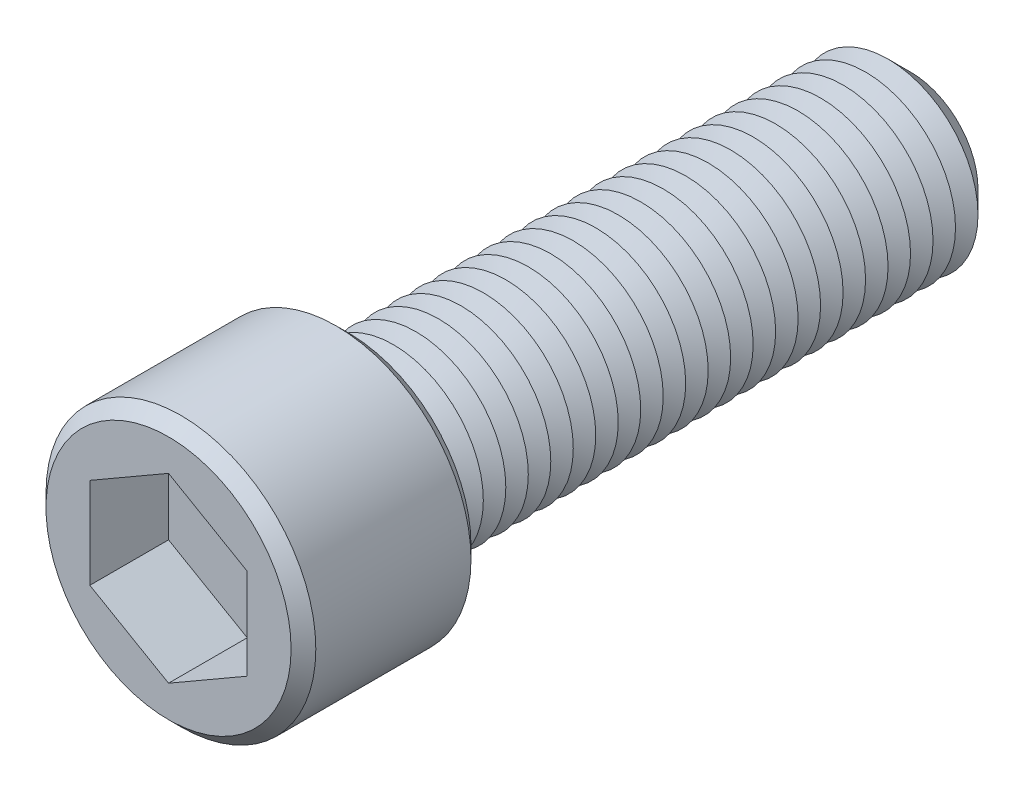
from build123d import *

# Parameters (mm, degrees)
SKETCH1_R           = 12
BOSS_EXTRUDE1_DEPTH = 16
SKETCH2_R           = 8
BOSS_EXTRUDE2_DEPTH = 50
CHAMFER1_SIZE       = 2
LPATTERN1_COUNT     = 24
LPATTERN1_PITCH     = 2
CUT_EXTRUDE1_DEPTH  = 7
SKETCH6_R           = 0.9
CUT_EXTRUDE2_DEPTH  = 59
CHAMFER2_SIZE       = 1.1


with BuildPart() as part:
    # Sketch1 → Boss-Extrude1 (new body)
    with BuildSketch(Plane.XY):
        Circle(SKETCH1_R)
    extrude(amount=BOSS_EXTRUDE1_DEPTH)

    # Sketch2 → Boss-Extrude2 (add)
    with BuildSketch(Plane(origin=(0, 0, 0), x_dir=(-1, 0, 0), z_dir=(0, 0, -1))):
        Circle(SKETCH2_R)
    extrude(amount=BOSS_EXTRUDE2_DEPTH)

    # Chamfer1
    chamfer1_edges = [part.edges().sort_by_distance(p)[0] for p in [
        (8, 0, -50),
    ]]
    chamfer(chamfer1_edges, length=CHAMFER1_SIZE)

    # Sketch4 → Cut-Revolve1 (revolve, cut)
    with BuildSketch(Plane(origin=(0, 0, 0), x_dir=(0, 0, -1), z_dir=(1, 0, 0)), mode=Mode.PRIVATE) as cut_revolve1_sk:
        Polygon((0, 8), (1, 6.267949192), (2, 8), align=None)
    cut_revolve1 = revolve(cut_revolve1_sk.sketch.rotate(Axis((0, 0, 2.512122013), (0, 0, -1)), 90), axis=Axis((0, 0, 2.512122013), (0, 0, -1)), mode=Mode.SUBTRACT)

    # LPattern1: Cut-Revolve1 ×24
    with Locations(*[(0, 0, -i * LPATTERN1_PITCH) for i in range(1, LPATTERN1_COUNT)]):
        add(cut_revolve1, mode=Mode.SUBTRACT)

    # Sketch5 → Cut-Extrude1 (cut)
    with BuildSketch(Plane.XY.offset(16)):
        Polygon((0, 8.082903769), (-7, 4.041451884), (-7, -4.041451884), (0, -8.082903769), (7, -4.041451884), (7, 4.041451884), align=None)
    extrude(amount=-CUT_EXTRUDE1_DEPTH, mode=Mode.SUBTRACT)

    # Sketch6 → Cut-Extrude2 (cut)
    with BuildSketch(Plane.XY.offset(9)):
        Circle(SKETCH6_R)
    extrude(amount=-CUT_EXTRUDE2_DEPTH, mode=Mode.SUBTRACT)

    # Chamfer2
    chamfer2_edges = [part.edges().sort_by_distance(p)[0] for p in [
        (-12, 0, 0),
        (-12, 0, 16),
    ]]
    chamfer(chamfer2_edges, length=CHAMFER2_SIZE)


solid = part.part
